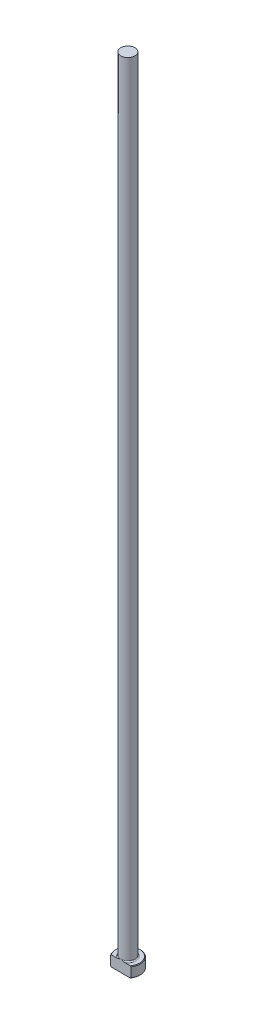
ISO-10303-21;
HEADER;
FILE_DESCRIPTION(('STEP AP214'),'2;1');
FILE_NAME('part.step','',(''),(''),'','','');
FILE_SCHEMA(('AUTOMOTIVE_DESIGN { 1 0 10303 214 1 1 1 1 }'));
ENDSEC;
DATA;
#1=APPLICATION_CONTEXT('core data for automotive mechanical design processes');
#2=APPLICATION_PROTOCOL_DEFINITION('international standard','automotive_design',2000,#1);
#3=PRODUCT_CONTEXT('',#1,'mechanical');
#4=PRODUCT('Part','Part','',(#3));
#5=PRODUCT_RELATED_PRODUCT_CATEGORY('part','',(#4));
#6=PRODUCT_DEFINITION_FORMATION('','',#4);
#7=PRODUCT_DEFINITION_CONTEXT('part definition',#1,'design');
#8=PRODUCT_DEFINITION('design','',#6,#7);
#9=PRODUCT_DEFINITION_SHAPE('','',#8);
#10=(LENGTH_UNIT() NAMED_UNIT(*) SI_UNIT(.MILLI.,.METRE.));
#11=(NAMED_UNIT(*) PLANE_ANGLE_UNIT() SI_UNIT($,.RADIAN.));
#12=(NAMED_UNIT(*) SI_UNIT($,.STERADIAN.) SOLID_ANGLE_UNIT());
#13=UNCERTAINTY_MEASURE_WITH_UNIT(LENGTH_MEASURE(1.E-05),#10,'distance_accuracy_value','');
#14=(GEOMETRIC_REPRESENTATION_CONTEXT(3) GLOBAL_UNCERTAINTY_ASSIGNED_CONTEXT((#13)) GLOBAL_UNIT_ASSIGNED_CONTEXT((#10,
#11,#12)) REPRESENTATION_CONTEXT('',''));
#15=CARTESIAN_POINT('',(0.,0.,0.));
#16=DIRECTION('',(0.,0.,1.));
#17=DIRECTION('',(1.,0.,0.));
#18=AXIS2_PLACEMENT_3D('',#15,#16,#17);
#19=CARTESIAN_POINT('',(0.,0.,0.));
#20=DIRECTION('',(0.,-1.,0.));
#21=DIRECTION('',(0.,0.,-1.));
#22=AXIS2_PLACEMENT_3D('',#19,#20,#21);
#23=PLANE('',#22);
#24=DIRECTION('',(1.,0.,0.));
#25=VECTOR('',#24,1.);
#26=CARTESIAN_POINT('',(-4.55200670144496,0.,3.17499999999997));
#27=LINE('',#26,#25);
#28=CARTESIAN_POINT('',(-4.23862381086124,0.,3.17499999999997));
#29=VERTEX_POINT('',#28);
#30=CARTESIAN_POINT('',(4.23862381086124,0.,3.17499999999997));
#31=VERTEX_POINT('',#30);
#32=EDGE_CURVE('E92',#29,#31,#27,.T.);
#33=ORIENTED_EDGE('',*,*,#32,.F.);
#34=CARTESIAN_POINT('',(0.,0.,0.));
#35=DIRECTION('',(0.,-1.,0.));
#36=DIRECTION('',(0.,0.,-1.));
#37=AXIS2_PLACEMENT_3D('',#34,#35,#36);
#38=CIRCLE('',#37,5.29589999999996);
#39=EDGE_CURVE('E105',#29,#31,#38,.T.);
#40=ORIENTED_EDGE('',*,*,#39,.T.);
#41=EDGE_LOOP('',(#33,#40));
#42=FACE_BOUND('',#41,.T.);
#43=ADVANCED_FACE('F37',(#42),#23,.T.);
#44=CARTESIAN_POINT('',(0.,259.958771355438,0.));
#45=DIRECTION('',(0.,1.,0.));
#46=DIRECTION('',(0.,0.,1.));
#47=AXIS2_PLACEMENT_3D('',#44,#45,#46);
#48=CYLINDRICAL_SURFACE('',#47,5.54989999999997);
#49=DIRECTION('',(0.,-1.,0.));
#50=VECTOR('',#49,1.);
#51=CARTESIAN_POINT('',(-4.55200670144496,355.6,3.17499999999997));
#52=LINE('',#51,#50);
#53=CARTESIAN_POINT('',(-4.55200670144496,4.49579999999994,3.17499999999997));
#54=VERTEX_POINT('',#53);
#55=CARTESIAN_POINT('',(-4.55200670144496,0.254000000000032,3.17499999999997));
#56=VERTEX_POINT('',#55);
#57=EDGE_CURVE('E95',#54,#56,#52,.T.);
#58=ORIENTED_EDGE('',*,*,#57,.F.);
#59=CARTESIAN_POINT('',(0.,4.49579999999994,0.));
#60=DIRECTION('',(0.,1.,0.));
#61=DIRECTION('',(0.,0.,1.));
#62=AXIS2_PLACEMENT_3D('',#59,#60,#61);
#63=CIRCLE('',#62,5.54989999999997);
#64=CARTESIAN_POINT('',(4.55200670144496,4.49579999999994,3.17499999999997));
#65=VERTEX_POINT('',#64);
#66=EDGE_CURVE('E109',#54,#65,#63,.F.);
#67=ORIENTED_EDGE('',*,*,#66,.T.);
#68=DIRECTION('',(0.,-1.,0.));
#69=VECTOR('',#68,1.);
#70=CARTESIAN_POINT('',(4.55200670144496,355.6,3.17499999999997));
#71=LINE('',#70,#69);
#72=CARTESIAN_POINT('',(4.55200670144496,0.254000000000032,3.17499999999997));
#73=VERTEX_POINT('',#72);
#74=EDGE_CURVE('E187',#65,#73,#71,.T.);
#75=ORIENTED_EDGE('',*,*,#74,.T.);
#76=CARTESIAN_POINT('',(0.,0.254000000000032,0.));
#77=DIRECTION('',(0.,-1.,0.));
#78=DIRECTION('',(0.,0.,-1.));
#79=AXIS2_PLACEMENT_3D('',#76,#77,#78);
#80=CIRCLE('',#79,5.54989999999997);
#81=EDGE_CURVE('E115',#73,#56,#80,.F.);
#82=ORIENTED_EDGE('',*,*,#81,.T.);
#83=EDGE_LOOP('',(#58,#67,#75,#82));
#84=FACE_BOUND('',#83,.T.);
#85=ADVANCED_FACE('F160',(#84),#48,.T.);
#86=CARTESIAN_POINT('',(-5.54989999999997,4.7498,0.));
#87=DIRECTION('',(0.,1.,0.));
#88=DIRECTION('',(0.,0.,1.));
#89=AXIS2_PLACEMENT_3D('',#86,#87,#88);
#90=PLANE('',#89);
#91=DIRECTION('',(-1.,0.,0.));
#92=VECTOR('',#91,1.);
#93=CARTESIAN_POINT('',(-5.54989999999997,4.7498,3.17499999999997));
#94=LINE('',#93,#92);
#95=CARTESIAN_POINT('',(4.2386238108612,4.7498,3.17499999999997));
#96=VERTEX_POINT('',#95);
#97=CARTESIAN_POINT('',(1.86651118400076,4.7498,3.17499999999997));
#98=VERTEX_POINT('',#97);
#99=EDGE_CURVE('E58',#96,#98,#94,.T.);
#100=ORIENTED_EDGE('',*,*,#99,.F.);
#101=CARTESIAN_POINT('',(0.,4.7498,0.));
#102=DIRECTION('',(0.,1.,0.));
#103=DIRECTION('',(0.,0.,1.));
#104=AXIS2_PLACEMENT_3D('',#101,#102,#103);
#105=CIRCLE('',#104,5.29589999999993);
#106=CARTESIAN_POINT('',(-4.2386238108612,4.7498,3.17499999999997));
#107=VERTEX_POINT('',#106);
#108=EDGE_CURVE('E182',#96,#107,#105,.T.);
#109=ORIENTED_EDGE('',*,*,#108,.T.);
#110=CARTESIAN_POINT('',(-1.86651118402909,4.74979999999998,3.17499999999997));
#111=VERTEX_POINT('',#110);
#112=EDGE_CURVE('E140',#111,#107,#94,.T.);
#113=ORIENTED_EDGE('',*,*,#112,.F.);
#114=CARTESIAN_POINT('',(0.,4.7498,0.));
#115=DIRECTION('',(0.,1.,0.));
#116=DIRECTION('',(0.,0.,1.));
#117=AXIS2_PLACEMENT_3D('',#114,#115,#116);
#118=CIRCLE('',#117,3.68299999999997);
#119=EDGE_CURVE('E112',#111,#98,#118,.F.);
#120=ORIENTED_EDGE('',*,*,#119,.T.);
#121=EDGE_LOOP('',(#100,#109,#113,#120));
#122=FACE_BOUND('',#121,.T.);
#123=ADVANCED_FACE('F164',(#122),#90,.T.);
#124=CARTESIAN_POINT('',(0.,259.958771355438,0.));
#125=DIRECTION('',(0.,1.,0.));
#126=DIRECTION('',(0.,0.,1.));
#127=AXIS2_PLACEMENT_3D('',#124,#125,#126);
#128=CYLINDRICAL_SURFACE('',#127,3.17499999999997);
#129=CARTESIAN_POINT('',(0.,5.25779999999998,0.));
#130=DIRECTION('',(0.,1.,0.));
#131=DIRECTION('',(0.,0.,1.));
#132=AXIS2_PLACEMENT_3D('',#129,#130,#131);
#133=CIRCLE('',#132,3.17499999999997);
#134=CARTESIAN_POINT('',(0.,5.25779999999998,3.17499999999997));
#135=VERTEX_POINT('',#134);
#136=EDGE_CURVE('E108',#135,#135,#133,.T.);
#137=ORIENTED_EDGE('',*,*,#136,.T.);
#138=EDGE_LOOP('',(#137));
#139=FACE_BOUND('',#138,.T.);
#140=CARTESIAN_POINT('',(0.,355.6,0.));
#141=DIRECTION('',(0.,1.,0.));
#142=DIRECTION('',(0.,0.,1.));
#143=AXIS2_PLACEMENT_3D('',#140,#141,#142);
#144=CIRCLE('',#143,3.17499999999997);
#145=CARTESIAN_POINT('',(0.,355.6,3.17499999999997));
#146=VERTEX_POINT('',#145);
#147=EDGE_CURVE('E100',#146,#146,#144,.T.);
#148=ORIENTED_EDGE('',*,*,#147,.F.);
#149=EDGE_LOOP('',(#148));
#150=FACE_BOUND('',#149,.T.);
#151=ADVANCED_FACE('F169',(#139,#150),#128,.T.);
#152=CARTESIAN_POINT('',(-3.17499999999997,355.6,0.));
#153=DIRECTION('',(0.,1.,0.));
#154=DIRECTION('',(0.,0.,1.));
#155=AXIS2_PLACEMENT_3D('',#152,#153,#154);
#156=PLANE('',#155);
#157=ORIENTED_EDGE('',*,*,#147,.T.);
#158=EDGE_LOOP('',(#157));
#159=FACE_BOUND('',#158,.T.);
#160=ADVANCED_FACE('F127',(#159),#156,.T.);
#161=CARTESIAN_POINT('',(0.,4.74980000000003,0.));
#162=DIRECTION('',(0.,-1.,0.));
#163=DIRECTION('',(0.,0.,-1.));
#164=AXIS2_PLACEMENT_3D('',#161,#162,#163);
#165=CONICAL_SURFACE('',#164,5.29589999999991,0.785398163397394);
#166=CARTESIAN_POINT('',(4.55270670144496,4.49522584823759,3.17499999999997));
#167=CARTESIAN_POINT('',(4.46867102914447,4.56415111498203,3.17499999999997));
#168=CARTESIAN_POINT('',(4.38433366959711,4.6327080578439,3.17499999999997));
#169=CARTESIAN_POINT('',(4.2149585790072,4.76896195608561,3.17499999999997));
#170=CARTESIAN_POINT('',(4.12992080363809,4.83665885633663,3.17499999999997));
#171=CARTESIAN_POINT('',(3.87336504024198,5.03846775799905,3.17499999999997));
#172=CARTESIAN_POINT('',(3.70066220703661,5.17108543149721,3.17499999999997));
#173=CARTESIAN_POINT('',(3.34705509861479,5.43386049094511,3.17499999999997));
#174=CARTESIAN_POINT('',(3.16605347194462,5.56388747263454,3.17499999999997));
#175=CARTESIAN_POINT('',(2.79841706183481,5.81560063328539,3.17499999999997));
#176=CARTESIAN_POINT('',(2.61178598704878,5.93729213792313,3.17499999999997));
#177=CARTESIAN_POINT('',(2.30973308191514,6.12043895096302,3.17499999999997));
#178=CARTESIAN_POINT('',(2.19679966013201,6.18598374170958,3.17499999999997));
#179=CARTESIAN_POINT('',(1.96784721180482,6.31155139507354,3.17499999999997));
#180=CARTESIAN_POINT('',(1.85182762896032,6.3715732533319,3.17499999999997));
#181=CARTESIAN_POINT('',(1.61688838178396,6.48418645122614,3.17499999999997));
#182=CARTESIAN_POINT('',(1.49798536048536,6.53681215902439,3.17499999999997));
#183=CARTESIAN_POINT('',(1.25651684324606,6.63289856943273,3.17499999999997));
#184=CARTESIAN_POINT('',(1.13395292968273,6.67636316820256,3.17499999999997));
#185=CARTESIAN_POINT('',(0.91783963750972,6.74185258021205,3.17499999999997));
#186=CARTESIAN_POINT('',(0.825091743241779,6.76651140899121,3.17499999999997));
#187=CARTESIAN_POINT('',(0.637965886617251,6.80852168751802,3.17499999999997));
#188=CARTESIAN_POINT('',(0.543588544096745,6.82587585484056,3.17499999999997));
#189=CARTESIAN_POINT('',(0.353913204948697,6.85241185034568,3.17499999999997));
#190=CARTESIAN_POINT('',(0.258618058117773,6.86161375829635,3.17499999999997));
#191=CARTESIAN_POINT('',(0.0675813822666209,6.87141333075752,3.17499999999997));
#192=CARTESIAN_POINT('',(-0.0281601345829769,6.87201122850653,3.17499999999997));
#193=CARTESIAN_POINT('',(-0.219319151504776,6.86456808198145,3.17499999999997));
#194=CARTESIAN_POINT('',(-0.314736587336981,6.85652541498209,3.17499999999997));
#195=CARTESIAN_POINT('',(-0.50451468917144,6.83224444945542,3.17499999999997));
#196=CARTESIAN_POINT('',(-0.598875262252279,6.8160054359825,3.17499999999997));
#197=CARTESIAN_POINT('',(-0.786308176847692,6.77606898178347,3.17499999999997));
#198=CARTESIAN_POINT('',(-0.879375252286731,6.75234715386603,3.17499999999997));
#199=CARTESIAN_POINT('',(-1.06359579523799,6.69844771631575,3.17499999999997));
#200=CARTESIAN_POINT('',(-1.15474927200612,6.66827013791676,3.17499999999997));
#201=CARTESIAN_POINT('',(-1.35443704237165,6.59537857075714,3.17499999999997));
#202=CARTESIAN_POINT('',(-1.46249374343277,6.5513642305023,3.17499999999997));
#203=CARTESIAN_POINT('',(-1.67575460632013,6.45687950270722,3.17499999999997));
#204=CARTESIAN_POINT('',(-1.78095773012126,6.40640680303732,3.17499999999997));
#205=CARTESIAN_POINT('',(-1.98893047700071,6.30024153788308,3.17499999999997));
#206=CARTESIAN_POINT('',(-2.09169504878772,6.24453915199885,3.17499999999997));
#207=CARTESIAN_POINT('',(-2.29487199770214,6.12905867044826,3.17499999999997));
#208=CARTESIAN_POINT('',(-2.39528472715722,6.06928119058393,3.17499999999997));
#209=CARTESIAN_POINT('',(-2.59468704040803,5.94608525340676,3.17499999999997));
#210=CARTESIAN_POINT('',(-2.69366424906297,5.88264685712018,3.17499999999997));
#211=CARTESIAN_POINT('',(-2.88985302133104,5.75309438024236,3.17499999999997));
#212=CARTESIAN_POINT('',(-2.9870644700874,5.6869801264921,3.17499999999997));
#213=CARTESIAN_POINT('',(-3.27623595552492,5.48553168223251,3.17499999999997));
#214=CARTESIAN_POINT('',(-3.46594038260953,5.34696081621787,3.17499999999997));
#215=CARTESIAN_POINT('',(-3.80657840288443,5.08982954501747,3.17499999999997));
#216=CARTESIAN_POINT('',(-3.95825741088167,4.97224445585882,3.17499999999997));
#217=CARTESIAN_POINT('',(-4.1832860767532,4.79418265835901,3.17499999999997));
#218=CARTESIAN_POINT('',(-4.25753159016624,4.73483567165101,3.17499999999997));
#219=CARTESIAN_POINT('',(-4.40549753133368,4.61549484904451,3.17499999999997));
#220=CARTESIAN_POINT('',(-4.47921797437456,4.5555010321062,3.17499999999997));
#221=CARTESIAN_POINT('',(-4.55270670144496,4.49522584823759,3.17499999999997));
#222=B_SPLINE_CURVE_WITH_KNOTS('',3,(#166,#167,#168,#169,#170,#171,#172,#173,#174,#175,#176,
#177,#178,#179,#180,#181,#182,#183,#184,#185,#186,#187,#188,#189,#190,#191,#192,#193,#194,#195,
#196,#197,#198,#199,#200,#201,#202,#203,#204,#205,#206,#207,#208,#209,#210,#211,#212,#213,#214,
#215,#216,#217,#218,#219,#220,#221),.UNSPECIFIED.,.F.,.F.,(4,2,2,2,2,2,2,2,2,2,2,2,2,2,2,2,2,2,
2,2,2,2,2,2,2,2,2,4),(0.,0.326056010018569,0.652132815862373,1.30528807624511,1.97374354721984,
2.64176786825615,3.03338079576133,3.42506479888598,3.81486388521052,4.20449685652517,
4.49215659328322,4.77970921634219,5.06655158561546,5.35338617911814,5.64027465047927,
5.92718815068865,6.2150465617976,6.50290358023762,6.85266171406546,7.20254541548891,
7.5530998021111,7.90360133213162,8.25623530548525,8.60889213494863,9.31347102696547,
9.88918933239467,10.174335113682,10.459472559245),.UNSPECIFIED.);
#223=EDGE_CURVE('E63',#65,#96,#222,.T.);
#224=ORIENTED_EDGE('',*,*,#223,.F.);
#225=ORIENTED_EDGE('',*,*,#66,.F.);
#226=EDGE_CURVE('E133',#107,#54,#222,.T.);
#227=ORIENTED_EDGE('',*,*,#226,.F.);
#228=ORIENTED_EDGE('',*,*,#108,.F.);
#229=EDGE_LOOP('',(#224,#225,#227,#228));
#230=FACE_BOUND('',#229,.T.);
#231=ADVANCED_FACE('F147',(#230),#165,.T.);
#232=CARTESIAN_POINT('',(0.,0.254000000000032,0.));
#233=DIRECTION('',(0.,1.,0.));
#234=DIRECTION('',(0.,0.,1.));
#235=AXIS2_PLACEMENT_3D('',#232,#233,#234);
#236=CONICAL_SURFACE('',#235,5.54989999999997,0.785398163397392);
#237=CARTESIAN_POINT('',(-4.55270670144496,0.254574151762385,3.17499999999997));
#238=CARTESIAN_POINT('',(-4.46867102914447,0.185648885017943,3.17499999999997));
#239=CARTESIAN_POINT('',(-4.38433366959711,0.117091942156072,3.17499999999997));
#240=CARTESIAN_POINT('',(-4.2149585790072,-0.019161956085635,3.17499999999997));
#241=CARTESIAN_POINT('',(-4.12992080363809,-0.0868588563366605,3.17499999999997));
#242=CARTESIAN_POINT('',(-3.87336504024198,-0.288667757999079,3.17499999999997));
#243=CARTESIAN_POINT('',(-3.70066220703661,-0.421285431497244,3.17499999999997));
#244=CARTESIAN_POINT('',(-3.3470550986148,-0.684060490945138,3.17499999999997));
#245=CARTESIAN_POINT('',(-3.16605347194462,-0.814087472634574,3.17499999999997));
#246=CARTESIAN_POINT('',(-2.79841706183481,-1.06580063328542,3.17499999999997));
#247=CARTESIAN_POINT('',(-2.61178598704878,-1.18749213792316,3.17499999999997));
#248=CARTESIAN_POINT('',(-2.30973308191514,-1.37063895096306,3.17499999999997));
#249=CARTESIAN_POINT('',(-2.19679966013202,-1.43618374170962,3.17499999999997));
#250=CARTESIAN_POINT('',(-1.96784721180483,-1.56175139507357,3.17499999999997));
#251=CARTESIAN_POINT('',(-1.85182762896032,-1.62177325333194,3.17499999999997));
#252=CARTESIAN_POINT('',(-1.61688838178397,-1.73438645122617,3.17499999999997));
#253=CARTESIAN_POINT('',(-1.49798536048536,-1.78701215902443,3.17499999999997));
#254=CARTESIAN_POINT('',(-1.25651684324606,-1.88309856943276,3.17499999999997));
#255=CARTESIAN_POINT('',(-1.13395292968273,-1.92656316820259,3.17499999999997));
#256=CARTESIAN_POINT('',(-0.917839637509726,-1.99205258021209,3.17499999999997));
#257=CARTESIAN_POINT('',(-0.825091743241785,-2.01671140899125,3.17499999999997));
#258=CARTESIAN_POINT('',(-0.637965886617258,-2.05872168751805,3.17499999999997));
#259=CARTESIAN_POINT('',(-0.543588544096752,-2.07607585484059,3.17499999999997));
#260=CARTESIAN_POINT('',(-0.353913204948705,-2.10261185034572,3.17499999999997));
#261=CARTESIAN_POINT('',(-0.258618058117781,-2.11181375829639,3.17499999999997));
#262=CARTESIAN_POINT('',(-0.0675813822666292,-2.12161333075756,3.17499999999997));
#263=CARTESIAN_POINT('',(0.0281601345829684,-2.12221122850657,3.17499999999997));
#264=CARTESIAN_POINT('',(0.219319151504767,-2.11476808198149,3.17499999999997));
#265=CARTESIAN_POINT('',(0.314736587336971,-2.10672541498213,3.17499999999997));
#266=CARTESIAN_POINT('',(0.50451468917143,-2.08244444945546,3.17499999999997));
#267=CARTESIAN_POINT('',(0.598875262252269,-2.06620543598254,3.17499999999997));
#268=CARTESIAN_POINT('',(0.786308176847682,-2.02626898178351,3.17499999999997));
#269=CARTESIAN_POINT('',(0.879375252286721,-2.00254715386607,3.17499999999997));
#270=CARTESIAN_POINT('',(1.06359579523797,-1.94864771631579,3.17499999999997));
#271=CARTESIAN_POINT('',(1.15474927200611,-1.91847013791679,3.17499999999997));
#272=CARTESIAN_POINT('',(1.35443704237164,-1.84557857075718,3.17499999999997));
#273=CARTESIAN_POINT('',(1.46249374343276,-1.80156423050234,3.17499999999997));
#274=CARTESIAN_POINT('',(1.67575460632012,-1.70707950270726,3.17499999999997));
#275=CARTESIAN_POINT('',(1.78095773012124,-1.65660680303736,3.17499999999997));
#276=CARTESIAN_POINT('',(1.98893047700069,-1.55044153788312,3.17499999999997));
#277=CARTESIAN_POINT('',(2.0916950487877,-1.49473915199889,3.17499999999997));
#278=CARTESIAN_POINT('',(2.29487199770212,-1.37925867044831,3.17499999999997));
#279=CARTESIAN_POINT('',(2.39528472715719,-1.31948119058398,3.17499999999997));
#280=CARTESIAN_POINT('',(2.59468704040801,-1.19628525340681,3.17499999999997));
#281=CARTESIAN_POINT('',(2.69366424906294,-1.13284685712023,3.17499999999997));
#282=CARTESIAN_POINT('',(2.88985302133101,-1.00329438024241,3.17499999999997));
#283=CARTESIAN_POINT('',(2.98706447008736,-0.937180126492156,3.17499999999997));
#284=CARTESIAN_POINT('',(3.27623595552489,-0.735731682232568,3.17499999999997));
#285=CARTESIAN_POINT('',(3.46594038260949,-0.597160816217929,3.17499999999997));
#286=CARTESIAN_POINT('',(3.8065784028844,-0.340029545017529,3.17499999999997));
#287=CARTESIAN_POINT('',(3.95825741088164,-0.222444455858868,3.17499999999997));
#288=CARTESIAN_POINT('',(4.18328607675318,-0.0443826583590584,3.17499999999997));
#289=CARTESIAN_POINT('',(4.25753159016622,0.0149643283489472,3.17499999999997));
#290=CARTESIAN_POINT('',(4.40549753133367,0.134305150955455,3.17499999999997));
#291=CARTESIAN_POINT('',(4.47921797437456,0.194298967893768,3.17499999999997));
#292=CARTESIAN_POINT('',(4.55270670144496,0.254574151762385,3.17499999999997));
#293=B_SPLINE_CURVE_WITH_KNOTS('',3,(#237,#238,#239,#240,#241,#242,#243,#244,#245,#246,#247,
#248,#249,#250,#251,#252,#253,#254,#255,#256,#257,#258,#259,#260,#261,#262,#263,#264,#265,#266,
#267,#268,#269,#270,#271,#272,#273,#274,#275,#276,#277,#278,#279,#280,#281,#282,#283,#284,#285,
#286,#287,#288,#289,#290,#291,#292),.UNSPECIFIED.,.F.,.F.,(4,2,2,2,2,2,2,2,2,2,2,2,2,2,2,2,2,2,
2,2,2,2,2,2,2,2,2,4),(0.,0.326056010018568,0.652132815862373,1.30528807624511,1.97374354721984,
2.64176786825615,3.03338079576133,3.42506479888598,3.81486388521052,4.20449685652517,
4.49215659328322,4.77970921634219,5.06655158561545,5.35338617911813,5.64027465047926,
5.92718815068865,6.21504656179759,6.50290358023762,6.85266171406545,7.20254541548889,
7.55309980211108,7.90360133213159,8.25623530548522,8.6088921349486,9.31347102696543,
9.88918933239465,10.174335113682,10.459472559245),.UNSPECIFIED.);
#294=EDGE_CURVE('E89',#56,#29,#293,.T.);
#295=ORIENTED_EDGE('',*,*,#294,.F.);
#296=ORIENTED_EDGE('',*,*,#81,.F.);
#297=EDGE_CURVE('E101',#31,#73,#293,.T.);
#298=ORIENTED_EDGE('',*,*,#297,.F.);
#299=ORIENTED_EDGE('',*,*,#39,.F.);
#300=EDGE_LOOP('',(#295,#296,#298,#299));
#301=FACE_BOUND('',#300,.T.);
#302=ADVANCED_FACE('F107',(#301),#236,.T.);
#303=CARTESIAN_POINT('',(0.,5.25779999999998,0.));
#304=DIRECTION('',(0.,1.,0.));
#305=DIRECTION('',(0.,0.,1.));
#306=AXIS2_PLACEMENT_3D('',#303,#304,#305);
#307=TOROIDAL_SURFACE('',#306,3.68299999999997,0.508);
#308=ORIENTED_EDGE('',*,*,#119,.F.);
#309=CARTESIAN_POINT('',(0.,5.25779999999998,3.17499999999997));
#310=CARTESIAN_POINT('',(-1.80769053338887E-10,5.25780081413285,3.17499999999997));
#311=CARTESIAN_POINT('',(-1.73023885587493E-07,5.25780162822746,3.17499999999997));
#312=CARTESIAN_POINT('',(-7.19628533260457E-07,5.25780319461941,3.17499999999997));
#313=CARTESIAN_POINT('',(-1.09883574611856E-06,5.25780394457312,3.17499999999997));
#314=CARTESIAN_POINT('',(-2.00966877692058E-06,5.25780544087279,3.17499999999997));
#315=CARTESIAN_POINT('',(-2.55212990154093E-06,5.25780618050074,3.17499999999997));
#316=CARTESIAN_POINT('',(-3.72136332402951E-06,5.25780757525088,3.17499999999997));
#317=CARTESIAN_POINT('',(-4.34736599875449E-06,5.25780823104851,3.17499999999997));
#318=CARTESIAN_POINT('',(-6.59438229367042E-06,5.25781043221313,3.17499999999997));
#319=CARTESIAN_POINT('',(-8.32481538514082E-06,5.25781186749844,3.17499999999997));
#320=CARTESIAN_POINT('',(-1.18988287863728E-05,5.25781442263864,3.17499999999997));
#321=CARTESIAN_POINT('',(-1.37358815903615E-05,5.25781555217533,3.17499999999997));
#322=CARTESIAN_POINT('',(-2.09135300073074E-05,5.25781980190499,3.17499999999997));
#323=CARTESIAN_POINT('',(-2.63912469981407E-05,5.25782270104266,3.17499999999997));
#324=CARTESIAN_POINT('',(-3.71867761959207E-05,5.25782743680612,3.17499999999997));
#325=CARTESIAN_POINT('',(-4.24736618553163E-05,5.25782934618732,3.17499999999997));
#326=CARTESIAN_POINT('',(-6.50188365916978E-05,5.25783746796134,3.17499999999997));
#327=CARTESIAN_POINT('',(-8.22815781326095E-05,5.25784363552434,3.17499999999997));
#328=CARTESIAN_POINT('',(-0.000114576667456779,5.25785352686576,3.17499999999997));
#329=CARTESIAN_POINT('',(-0.000129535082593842,5.25785748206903,3.17499999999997));
#330=CARTESIAN_POINT('',(-0.000238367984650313,5.25788883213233,3.17499999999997));
#331=CARTESIAN_POINT('',(-0.000328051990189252,5.25792882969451,3.17499999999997));
#332=CARTESIAN_POINT('',(-0.000676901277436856,5.25807871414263,3.17499999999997));
#333=CARTESIAN_POINT('',(-0.000938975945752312,5.25817923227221,3.17499999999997));
#334=CARTESIAN_POINT('',(-0.001957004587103,5.25857549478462,3.17499999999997));
#335=CARTESIAN_POINT('',(-0.00270997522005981,5.25888105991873,3.17499999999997));
#336=CARTESIAN_POINT('',(-0.00579427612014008,5.26012678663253,3.17499999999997));
#337=CARTESIAN_POINT('',(-0.00812889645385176,5.26105588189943,3.17499999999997));
#338=CARTESIAN_POINT('',(-0.0536737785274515,5.27918868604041,3.17499999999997));
#339=CARTESIAN_POINT('',(-0.0968493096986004,5.29651116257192,3.17499999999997));
#340=CARTESIAN_POINT('',(-0.181675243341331,5.33030366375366,3.17499999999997));
#341=CARTESIAN_POINT('',(-0.22332279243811,5.34678146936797,3.17499999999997));
#342=CARTESIAN_POINT('',(-0.311600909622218,5.38141206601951,3.17499999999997));
#343=CARTESIAN_POINT('',(-0.358243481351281,5.39953485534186,3.17499999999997));
#344=CARTESIAN_POINT('',(-0.452199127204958,5.43546002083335,3.17499999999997));
#345=CARTESIAN_POINT('',(-0.499514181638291,5.4532572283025,3.17499999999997));
#346=CARTESIAN_POINT('',(-0.581915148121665,5.48356219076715,3.17499999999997));
#347=CARTESIAN_POINT('',(-0.616942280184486,5.49622931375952,3.17499999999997));
#348=CARTESIAN_POINT('',(-0.687074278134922,5.52107238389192,3.17499999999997));
#349=CARTESIAN_POINT('',(-0.722178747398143,5.53324945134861,3.17499999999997));
#350=CARTESIAN_POINT('',(-0.82617821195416,5.56842938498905,3.17499999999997));
#351=CARTESIAN_POINT('',(-0.895335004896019,5.59066808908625,3.17499999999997));
#352=CARTESIAN_POINT('',(-1.04440355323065,5.63534989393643,3.17499999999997));
#353=CARTESIAN_POINT('',(-1.12444395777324,5.65737079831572,3.17499999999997));
#354=CARTESIAN_POINT('',(-1.28636529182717,5.69671209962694,3.17499999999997));
#355=CARTESIAN_POINT('',(-1.36825573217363,5.71399428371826,3.17499999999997));
#356=CARTESIAN_POINT('',(-1.53827501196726,5.74289044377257,3.17499999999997));
#357=CARTESIAN_POINT('',(-1.6264772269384,5.754089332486,3.17499999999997));
#358=CARTESIAN_POINT('',(-1.80336979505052,5.766538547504,3.17499999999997));
#359=CARTESIAN_POINT('',(-1.89205668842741,5.76782927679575,3.17499999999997));
#360=CARTESIAN_POINT('',(-2.04614946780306,5.75829207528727,3.17499999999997));
#361=CARTESIAN_POINT('',(-2.1117267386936,5.7504696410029,3.17499999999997));
#362=CARTESIAN_POINT('',(-2.24032569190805,5.72527330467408,3.17499999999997));
#363=CARTESIAN_POINT('',(-2.30336992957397,5.70802985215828,3.17499999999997));
#364=CARTESIAN_POINT('',(-2.3964725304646,5.67213651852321,3.17499999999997));
#365=CARTESIAN_POINT('',(-2.42822079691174,5.65788049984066,3.17499999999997));
#366=CARTESIAN_POINT('',(-2.48965433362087,5.62525897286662,3.17499999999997));
#367=CARTESIAN_POINT('',(-2.51933677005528,5.60688795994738,3.17499999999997));
#368=CARTESIAN_POINT('',(-2.56994777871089,5.56951032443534,3.17499999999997));
#369=CARTESIAN_POINT('',(-2.59146237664,5.55130442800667,3.17499999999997));
#370=CARTESIAN_POINT('',(-2.63132394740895,5.5117021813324,3.17499999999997));
#371=CARTESIAN_POINT('',(-2.64967743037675,5.49031256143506,3.17499999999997));
#372=CARTESIAN_POINT('',(-2.67804602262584,5.4500327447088,3.17499999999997));
#373=CARTESIAN_POINT('',(-2.6890027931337,5.43180880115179,3.17499999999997));
#374=CARTESIAN_POINT('',(-2.7078017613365,5.3938065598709,3.17499999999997));
#375=CARTESIAN_POINT('',(-2.71564587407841,5.37402922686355,3.17499999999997));
#376=CARTESIAN_POINT('',(-2.72769754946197,5.33322214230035,3.17499999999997));
#377=CARTESIAN_POINT('',(-2.73187843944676,5.31218437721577,3.17499999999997));
#378=CARTESIAN_POINT('',(-2.73613267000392,5.26969745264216,3.17499999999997));
#379=CARTESIAN_POINT('',(-2.73620805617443,5.24824850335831,3.17499999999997));
#380=CARTESIAN_POINT('',(-2.73247730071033,5.20813635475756,3.17499999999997));
#381=CARTESIAN_POINT('',(-2.72910595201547,5.18943073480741,3.17499999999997));
#382=CARTESIAN_POINT('',(-2.71937153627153,5.15282145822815,3.17499999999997));
#383=CARTESIAN_POINT('',(-2.71300800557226,5.13491792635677,3.17499999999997));
#384=CARTESIAN_POINT('',(-2.69740230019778,5.0996670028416,3.17499999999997));
#385=CARTESIAN_POINT('',(-2.68806645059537,5.08236154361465,3.17499999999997));
#386=CARTESIAN_POINT('',(-2.66708571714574,5.04922644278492,3.17499999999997));
#387=CARTESIAN_POINT('',(-2.65543987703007,5.03339741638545,3.17499999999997));
#388=CARTESIAN_POINT('',(-2.62294588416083,4.99450310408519,3.17499999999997));
#389=CARTESIAN_POINT('',(-2.60069446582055,4.9726078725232,3.17499999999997));
#390=CARTESIAN_POINT('',(-2.55299669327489,4.93259922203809,3.17499999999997));
#391=CARTESIAN_POINT('',(-2.52754047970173,4.91449795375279,3.17499999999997));
#392=CARTESIAN_POINT('',(-2.46015073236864,4.87290115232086,3.17499999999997));
#393=CARTESIAN_POINT('',(-2.41675555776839,4.85178783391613,3.17499999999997));
#394=CARTESIAN_POINT('',(-2.32743780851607,4.81642640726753,3.17499999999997));
#395=CARTESIAN_POINT('',(-2.28151740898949,4.80217249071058,3.17499999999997));
#396=CARTESIAN_POINT('',(-2.19492730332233,4.78086425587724,3.17499999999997));
#397=CARTESIAN_POINT('',(-2.15443153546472,4.77307762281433,3.17499999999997));
#398=CARTESIAN_POINT('',(-2.07290577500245,4.7609987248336,3.17499999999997));
#399=CARTESIAN_POINT('',(-2.03187536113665,4.75670940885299,3.17499999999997));
#400=CARTESIAN_POINT('',(-1.90717655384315,4.74822293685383,3.17499999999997));
#401=CARTESIAN_POINT('',(-1.82319261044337,4.74868666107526,3.17499999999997));
#402=CARTESIAN_POINT('',(-1.62833175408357,4.76032593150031,3.17499999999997));
#403=CARTESIAN_POINT('',(-1.51770881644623,4.77497959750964,3.17499999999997));
#404=CARTESIAN_POINT('',(-1.29813873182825,4.81534590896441,3.17499999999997));
#405=CARTESIAN_POINT('',(-1.18920134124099,4.84110792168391,3.17499999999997));
#406=CARTESIAN_POINT('',(-0.982215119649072,4.89780610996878,3.17499999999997));
#407=CARTESIAN_POINT('',(-0.883999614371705,4.92815337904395,3.17499999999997));
#408=CARTESIAN_POINT('',(-0.689996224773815,4.99284004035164,3.17499999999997));
#409=CARTESIAN_POINT('',(-0.594193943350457,5.02713703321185,3.17499999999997));
#410=CARTESIAN_POINT('',(-0.464142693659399,5.07567249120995,3.17499999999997));
#411=CARTESIAN_POINT('',(-0.429471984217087,5.08880513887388,3.17499999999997));
#412=CARTESIAN_POINT('',(-0.359331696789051,5.11568278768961,3.17499999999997));
#413=CARTESIAN_POINT('',(-0.323864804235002,5.12943483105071,3.17499999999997));
#414=CARTESIAN_POINT('',(-0.263992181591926,5.15284621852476,3.17499999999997));
#415=CARTESIAN_POINT('',(-0.239565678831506,5.16245280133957,3.17499999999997));
#416=CARTESIAN_POINT('',(-0.190982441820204,5.18164529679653,3.17499999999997));
#417=CARTESIAN_POINT('',(-0.166825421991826,5.19123047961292,3.17499999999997));
#418=CARTESIAN_POINT('',(-0.121037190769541,5.20943918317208,3.17499999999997));
#419=CARTESIAN_POINT('',(-0.0994044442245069,5.21805909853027,3.17499999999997));
#420=CARTESIAN_POINT('',(-0.0553410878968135,5.2356763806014,3.17499999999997));
#421=CARTESIAN_POINT('',(-0.0329111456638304,5.24467572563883,3.17499999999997));
#422=CARTESIAN_POINT('',(-0.00813211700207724,5.25454302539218,3.17499999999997));
#423=CARTESIAN_POINT('',(-0.00580062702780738,5.25547072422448,3.17499999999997));
#424=CARTESIAN_POINT('',(-0.00271708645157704,5.25671609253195,3.17499999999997));
#425=CARTESIAN_POINT('',(-0.00196172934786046,5.25702263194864,3.17499999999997));
#426=CARTESIAN_POINT('',(-0.000940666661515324,5.25742007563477,3.17499999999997));
#427=CARTESIAN_POINT('',(-0.000677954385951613,5.25752083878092,3.17499999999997));
#428=CARTESIAN_POINT('',(-0.000328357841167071,5.25767104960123,3.17499999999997));
#429=CARTESIAN_POINT('',(-0.000238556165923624,5.25771109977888,3.17499999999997));
#430=CARTESIAN_POINT('',(-0.000129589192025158,5.25774247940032,3.17499999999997));
#431=CARTESIAN_POINT('',(-0.000114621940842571,5.25774643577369,3.17499999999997));
#432=CARTESIAN_POINT('',(-8.23074123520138E-05,5.25775633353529,3.17499999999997));
#433=CARTESIAN_POINT('',(-6.50343069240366E-05,5.25776250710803,3.17499999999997));
#434=CARTESIAN_POINT('',(-4.24775013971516E-05,5.25777063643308,3.17499999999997));
#435=CARTESIAN_POINT('',(-3.71892385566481E-05,5.25777254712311,3.17499999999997));
#436=CARTESIAN_POINT('',(-2.63911145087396E-05,5.25777728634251,3.17499999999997));
#437=CARTESIAN_POINT('',(-2.09122302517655E-05,5.25778018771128,3.17499999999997));
#438=CARTESIAN_POINT('',(-1.37334835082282E-05,5.25778444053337,3.17499999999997));
#439=CARTESIAN_POINT('',(-1.189632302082E-05,5.25778557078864,3.17499999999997));
#440=CARTESIAN_POINT('',(-8.32223670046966E-06,5.25778812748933,3.17499999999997));
#441=CARTESIAN_POINT('',(-6.59184566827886E-06,5.25778956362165,3.17499999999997));
#442=CARTESIAN_POINT('',(-4.34505756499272E-06,5.25779176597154,3.17499999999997));
#443=CARTESIAN_POINT('',(-3.71915459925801E-06,5.25779242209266,3.17499999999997));
#444=CARTESIAN_POINT('',(-2.55017854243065E-06,5.25779381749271,3.17499999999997));
#445=CARTESIAN_POINT('',(-2.00787573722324E-06,5.25779455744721,3.17499999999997));
#446=CARTESIAN_POINT('',(-1.09742559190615E-06,5.25779605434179,3.17499999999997));
#447=CARTESIAN_POINT('',(-7.18435041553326E-07,5.25779680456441,3.17499999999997));
#448=CARTESIAN_POINT('',(-1.72356606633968E-07,5.25779837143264,3.17499999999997));
#449=CARTESIAN_POINT('',(1.80798290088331E-10,5.25779918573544,3.17499999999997));
#450=CARTESIAN_POINT('',(0.,5.25779999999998,3.17499999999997));
#451=B_SPLINE_CURVE_WITH_KNOTS('',3,(#309,#310,#311,#312,#313,#314,#315,#316,#317,#318,#319,
#320,#321,#322,#323,#324,#325,#326,#327,#328,#329,#330,#331,#332,#333,#334,#335,#336,#337,#338,
#339,#340,#341,#342,#343,#344,#345,#346,#347,#348,#349,#350,#351,#352,#353,#354,#355,#356,#357,
#358,#359,#360,#361,#362,#363,#364,#365,#366,#367,#368,#369,#370,#371,#372,#373,#374,#375,#376,
#377,#378,#379,#380,#381,#382,#383,#384,#385,#386,#387,#388,#389,#390,#391,#392,#393,#394,#395,
#396,#397,#398,#399,#400,#401,#402,#403,#404,#405,#406,#407,#408,#409,#410,#411,#412,#413,#414,
#415,#416,#417,#418,#419,#420,#421,#422,#423,#424,#425,#426,#427,#428,#429,#430,#431,#432,#433,
#434,#435,#436,#437,#438,#439,#440,#441,#442,#443,#444,#445,#446,#447,#448,#449,#450),
.UNSPECIFIED.,.T.,.F.,(4,2,2,2,2,2,2,2,2,2,2,2,2,2,2,2,2,2,2,2,2,2,2,2,2,2,2,2,2,2,2,2,2,2,2,2,
2,2,2,2,2,2,2,2,2,2,2,2,2,2,2,2,2,2,2,2,2,2,2,2,2,2,2,2,2,2,2,2,2,2,4),(0.,2.44115442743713E-06,
4.95009294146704E-06,7.69053481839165E-06,1.04072793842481E-05,1.71193004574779E-05,
2.35837539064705E-05,4.21184942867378E-05,5.89639869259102E-05,0.000113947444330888,
0.00016032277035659,0.000453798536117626,0.00129678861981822,0.00373346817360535,
0.0112727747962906,0.150820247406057,0.285189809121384,0.435305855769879,0.586956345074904,
0.698695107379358,0.810161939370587,1.02805278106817,1.27698376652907,1.52786673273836,
1.79421526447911,2.05947711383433,2.25711645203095,2.4520860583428,2.55626736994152,
2.66058888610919,2.74486087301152,2.82895717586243,2.89250582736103,2.95601532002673,
3.01998348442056,3.08391977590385,3.14067853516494,3.1974460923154,3.25621727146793,
3.31501283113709,3.4081316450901,3.50154427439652,3.64551034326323,3.78935429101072,
3.91289118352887,4.03653213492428,4.28773663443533,4.6216869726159,4.95713698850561,
5.26538775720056,5.57059335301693,5.68181719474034,5.79593491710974,5.87467803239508,
5.9526448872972,6.02250735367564,6.09500368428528,6.10253275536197,6.10497716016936,
6.10582220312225,6.10611606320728,6.1061624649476,6.10621748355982,6.10623433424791,
6.10625287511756,6.10625934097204,6.10626605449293,6.10626877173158,6.10627151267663,
6.10627402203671,6.10627646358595),.UNSPECIFIED.);
#452=EDGE_CURVE('E11',#111,#135,#451,.T.);
#453=ORIENTED_EDGE('',*,*,#452,.T.);
#454=ORIENTED_EDGE('',*,*,#136,.F.);
#455=CARTESIAN_POINT('',(0.,5.25779999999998,3.17499999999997));
#456=CARTESIAN_POINT('',(1.8076887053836E-10,5.25779918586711,3.17499999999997));
#457=CARTESIAN_POINT('',(1.73023885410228E-07,5.25779837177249,3.17499999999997));
#458=CARTESIAN_POINT('',(7.19628533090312E-07,5.25779680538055,3.17499999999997));
#459=CARTESIAN_POINT('',(1.09883574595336E-06,5.25779605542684,3.17499999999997));
#460=CARTESIAN_POINT('',(2.00966877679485E-06,5.25779455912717,3.17499999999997));
#461=CARTESIAN_POINT('',(2.55212990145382E-06,5.25779381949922,3.17499999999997));
#462=CARTESIAN_POINT('',(3.72136332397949E-06,5.25779242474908,3.17499999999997));
#463=CARTESIAN_POINT('',(4.34736599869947E-06,5.25779176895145,3.17499999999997));
#464=CARTESIAN_POINT('',(6.59438229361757E-06,5.25778956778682,3.17499999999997));
#465=CARTESIAN_POINT('',(8.32481538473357E-06,5.25778813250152,3.17499999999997));
#466=CARTESIAN_POINT('',(1.18988287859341E-05,5.25778557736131,3.17499999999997));
#467=CARTESIAN_POINT('',(1.37358815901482E-05,5.25778444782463,3.17499999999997));
#468=CARTESIAN_POINT('',(2.09135300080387E-05,5.25778019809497,3.17499999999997));
#469=CARTESIAN_POINT('',(2.63912469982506E-05,5.2577772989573,3.17499999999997));
#470=CARTESIAN_POINT('',(3.71867761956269E-05,5.25777256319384,3.17499999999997));
#471=CARTESIAN_POINT('',(4.24736618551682E-05,5.25777065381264,3.17499999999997));
#472=CARTESIAN_POINT('',(6.50188365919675E-05,5.25776253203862,3.17499999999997));
#473=CARTESIAN_POINT('',(8.22815781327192E-05,5.25775636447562,3.17499999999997));
#474=CARTESIAN_POINT('',(0.000114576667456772,5.2577464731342,3.17499999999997));
#475=CARTESIAN_POINT('',(0.00012953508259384,5.25774251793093,3.17499999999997));
#476=CARTESIAN_POINT('',(0.000238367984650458,5.25771116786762,3.17499999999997));
#477=CARTESIAN_POINT('',(0.000328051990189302,5.25767117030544,3.17499999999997));
#478=CARTESIAN_POINT('',(0.00067690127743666,5.25752128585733,3.17499999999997));
#479=CARTESIAN_POINT('',(0.000938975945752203,5.25742076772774,3.17499999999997));
#480=CARTESIAN_POINT('',(0.00195700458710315,5.25702450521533,3.17499999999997));
#481=CARTESIAN_POINT('',(0.00270997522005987,5.25671894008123,3.17499999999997));
#482=CARTESIAN_POINT('',(0.00579427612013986,5.25547321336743,3.17499999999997));
#483=CARTESIAN_POINT('',(0.00812889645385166,5.25454411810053,3.17499999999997));
#484=CARTESIAN_POINT('',(0.0536737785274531,5.23641131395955,3.17499999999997));
#485=CARTESIAN_POINT('',(0.0968493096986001,5.21908883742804,3.17499999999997));
#486=CARTESIAN_POINT('',(0.181675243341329,5.1852963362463,3.17499999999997));
#487=CARTESIAN_POINT('',(0.223322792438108,5.16881853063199,3.17499999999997));
#488=CARTESIAN_POINT('',(0.311600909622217,5.13418793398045,3.17499999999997));
#489=CARTESIAN_POINT('',(0.35824348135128,5.1160651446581,3.17499999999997));
#490=CARTESIAN_POINT('',(0.452199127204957,5.08013997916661,3.17499999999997));
#491=CARTESIAN_POINT('',(0.49951418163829,5.06234277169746,3.17499999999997));
#492=CARTESIAN_POINT('',(0.581915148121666,5.03203780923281,3.17499999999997));
#493=CARTESIAN_POINT('',(0.616942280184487,5.01937068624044,3.17499999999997));
#494=CARTESIAN_POINT('',(0.687074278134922,4.99452761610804,3.17499999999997));
#495=CARTESIAN_POINT('',(0.722178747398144,4.98235054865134,3.17499999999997));
#496=CARTESIAN_POINT('',(0.826178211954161,4.94717061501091,3.17499999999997));
#497=CARTESIAN_POINT('',(0.895335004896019,4.9249319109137,3.17499999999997));
#498=CARTESIAN_POINT('',(1.04440355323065,4.88025010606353,3.17499999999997));
#499=CARTESIAN_POINT('',(1.12444395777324,4.85822920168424,3.17499999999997));
#500=CARTESIAN_POINT('',(1.28636529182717,4.81888790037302,3.17499999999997));
#501=CARTESIAN_POINT('',(1.36825573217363,4.8016057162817,3.17499999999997));
#502=CARTESIAN_POINT('',(1.53827501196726,4.77270955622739,3.17499999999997));
#503=CARTESIAN_POINT('',(1.6264772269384,4.76151066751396,3.17499999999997));
#504=CARTESIAN_POINT('',(1.80336979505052,4.74906145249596,3.17499999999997));
#505=CARTESIAN_POINT('',(1.89205668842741,4.74777072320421,3.17499999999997));
#506=CARTESIAN_POINT('',(2.04614946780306,4.75730792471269,3.17499999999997));
#507=CARTESIAN_POINT('',(2.1117267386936,4.76513035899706,3.17499999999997));
#508=CARTESIAN_POINT('',(2.24032569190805,4.79032669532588,3.17499999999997));
#509=CARTESIAN_POINT('',(2.30336992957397,4.80757014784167,3.17499999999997));
#510=CARTESIAN_POINT('',(2.3964725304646,4.84346348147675,3.17499999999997));
#511=CARTESIAN_POINT('',(2.42822079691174,4.8577195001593,3.17499999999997));
#512=CARTESIAN_POINT('',(2.48965433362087,4.89034102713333,3.17499999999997));
#513=CARTESIAN_POINT('',(2.51933677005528,4.90871204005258,3.17499999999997));
#514=CARTESIAN_POINT('',(2.56994777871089,4.94608967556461,3.17499999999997));
#515=CARTESIAN_POINT('',(2.59146237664,4.96429557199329,3.17499999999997));
#516=CARTESIAN_POINT('',(2.63132394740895,5.00389781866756,3.17499999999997));
#517=CARTESIAN_POINT('',(2.64967743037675,5.0252874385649,3.17499999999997));
#518=CARTESIAN_POINT('',(2.67804602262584,5.06556725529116,3.17499999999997));
#519=CARTESIAN_POINT('',(2.6890027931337,5.08379119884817,3.17499999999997));
#520=CARTESIAN_POINT('',(2.7078017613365,5.12179344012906,3.17499999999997));
#521=CARTESIAN_POINT('',(2.71564587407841,5.14157077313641,3.17499999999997));
#522=CARTESIAN_POINT('',(2.72769754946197,5.18237785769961,3.17499999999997));
#523=CARTESIAN_POINT('',(2.73187843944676,5.20341562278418,3.17499999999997));
#524=CARTESIAN_POINT('',(2.73613267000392,5.24590254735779,3.17499999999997));
#525=CARTESIAN_POINT('',(2.73620805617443,5.26735149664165,3.17499999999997));
#526=CARTESIAN_POINT('',(2.73247730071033,5.3074636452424,3.17499999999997));
#527=CARTESIAN_POINT('',(2.72910595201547,5.32616926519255,3.17499999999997));
#528=CARTESIAN_POINT('',(2.71937153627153,5.3627785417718,3.17499999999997));
#529=CARTESIAN_POINT('',(2.71300800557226,5.38068207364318,3.17499999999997));
#530=CARTESIAN_POINT('',(2.69740230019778,5.41593299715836,3.17499999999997));
#531=CARTESIAN_POINT('',(2.68806645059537,5.43323845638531,3.17499999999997));
#532=CARTESIAN_POINT('',(2.66708571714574,5.46637355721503,3.17499999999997));
#533=CARTESIAN_POINT('',(2.65543987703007,5.48220258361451,3.17499999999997));
#534=CARTESIAN_POINT('',(2.62294588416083,5.52109689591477,3.17499999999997));
#535=CARTESIAN_POINT('',(2.60069446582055,5.54299212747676,3.17499999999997));
#536=CARTESIAN_POINT('',(2.55299669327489,5.58300077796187,3.17499999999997));
#537=CARTESIAN_POINT('',(2.52754047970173,5.60110204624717,3.17499999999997));
#538=CARTESIAN_POINT('',(2.46015073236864,5.6426988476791,3.17499999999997));
#539=CARTESIAN_POINT('',(2.41675555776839,5.66381216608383,3.17499999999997));
#540=CARTESIAN_POINT('',(2.32743780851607,5.69917359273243,3.17499999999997));
#541=CARTESIAN_POINT('',(2.28151740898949,5.71342750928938,3.17499999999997));
#542=CARTESIAN_POINT('',(2.19492730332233,5.73473574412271,3.17499999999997));
#543=CARTESIAN_POINT('',(2.15443153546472,5.74252237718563,3.17499999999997));
#544=CARTESIAN_POINT('',(2.07290577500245,5.75460127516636,3.17499999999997));
#545=CARTESIAN_POINT('',(2.03187536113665,5.75889059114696,3.17499999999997));
#546=CARTESIAN_POINT('',(1.90717655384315,5.76737706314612,3.17499999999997));
#547=CARTESIAN_POINT('',(1.82319261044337,5.7669133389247,3.17499999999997));
#548=CARTESIAN_POINT('',(1.62833175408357,5.75527406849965,3.17499999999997));
#549=CARTESIAN_POINT('',(1.51770881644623,5.74062040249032,3.17499999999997));
#550=CARTESIAN_POINT('',(1.29813873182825,5.70025409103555,3.17499999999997));
#551=CARTESIAN_POINT('',(1.18920134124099,5.67449207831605,3.17499999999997));
#552=CARTESIAN_POINT('',(0.982215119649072,5.61779389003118,3.17499999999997));
#553=CARTESIAN_POINT('',(0.883999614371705,5.58744662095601,3.17499999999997));
#554=CARTESIAN_POINT('',(0.689996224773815,5.52275995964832,3.17499999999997));
#555=CARTESIAN_POINT('',(0.594193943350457,5.48846296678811,3.17499999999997));
#556=CARTESIAN_POINT('',(0.464142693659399,5.43992750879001,3.17499999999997));
#557=CARTESIAN_POINT('',(0.429471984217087,5.42679486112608,3.17499999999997));
#558=CARTESIAN_POINT('',(0.359331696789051,5.39991721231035,3.17499999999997));
#559=CARTESIAN_POINT('',(0.323864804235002,5.38616516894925,3.17499999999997));
#560=CARTESIAN_POINT('',(0.263992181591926,5.3627537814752,3.17499999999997));
#561=CARTESIAN_POINT('',(0.239565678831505,5.35314719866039,3.17499999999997));
#562=CARTESIAN_POINT('',(0.190982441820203,5.33395470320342,3.17499999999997));
#563=CARTESIAN_POINT('',(0.166825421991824,5.32436952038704,3.17499999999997));
#564=CARTESIAN_POINT('',(0.121037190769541,5.30616081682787,3.17499999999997));
#565=CARTESIAN_POINT('',(0.0994044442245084,5.29754090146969,3.17499999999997));
#566=CARTESIAN_POINT('',(0.0553410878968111,5.27992361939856,3.17499999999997));
#567=CARTESIAN_POINT('',(0.0329111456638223,5.27092427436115,3.17499999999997));
#568=CARTESIAN_POINT('',(0.00813211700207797,5.26105697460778,3.17499999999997));
#569=CARTESIAN_POINT('',(0.00580062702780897,5.26012927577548,3.17499999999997));
#570=CARTESIAN_POINT('',(0.00271708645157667,5.25888390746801,3.17499999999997));
#571=CARTESIAN_POINT('',(0.00196172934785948,5.25857736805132,3.17499999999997));
#572=CARTESIAN_POINT('',(0.000940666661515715,5.25817992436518,3.17499999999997));
#573=CARTESIAN_POINT('',(0.000677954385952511,5.25807916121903,3.17499999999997));
#574=CARTESIAN_POINT('',(0.000328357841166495,5.25792895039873,3.17499999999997));
#575=CARTESIAN_POINT('',(0.0002385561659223,5.25788890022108,3.17499999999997));
#576=CARTESIAN_POINT('',(0.000129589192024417,5.25785752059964,3.17499999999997));
#577=CARTESIAN_POINT('',(0.000114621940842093,5.25785356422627,3.17499999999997));
#578=CARTESIAN_POINT('',(8.23074123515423E-05,5.25784366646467,3.17499999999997));
#579=CARTESIAN_POINT('',(6.50343069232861E-05,5.25783749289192,3.17499999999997));
#580=CARTESIAN_POINT('',(4.24775013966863E-05,5.25782936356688,3.17499999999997));
#581=CARTESIAN_POINT('',(3.71892385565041E-05,5.25782745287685,3.17499999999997));
#582=CARTESIAN_POINT('',(2.63911145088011E-05,5.25782271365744,3.17499999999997));
#583=CARTESIAN_POINT('',(2.0912230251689E-05,5.25781981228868,3.17499999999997));
#584=CARTESIAN_POINT('',(1.37334835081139E-05,5.25781555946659,3.17499999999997));
#585=CARTESIAN_POINT('',(1.18963230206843E-05,5.25781442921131,3.17499999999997));
#586=CARTESIAN_POINT('',(8.32223670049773E-06,5.25781187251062,3.17499999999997));
#587=CARTESIAN_POINT('',(6.59184566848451E-06,5.2578104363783,3.17499999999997));
#588=CARTESIAN_POINT('',(4.34505756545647E-06,5.25780823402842,3.17499999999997));
#589=CARTESIAN_POINT('',(3.71915459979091E-06,5.2578075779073,3.17499999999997));
#590=CARTESIAN_POINT('',(2.55017854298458E-06,5.25780618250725,3.17499999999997));
#591=CARTESIAN_POINT('',(2.00787573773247E-06,5.25780544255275,3.17499999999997));
#592=CARTESIAN_POINT('',(1.09742559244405E-06,5.25780394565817,3.17499999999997));
#593=CARTESIAN_POINT('',(7.18435042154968E-07,5.25780319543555,3.17499999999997));
#594=CARTESIAN_POINT('',(1.72356607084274E-07,5.25780162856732,3.17499999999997));
#595=CARTESIAN_POINT('',(-1.8079810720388E-10,5.25780081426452,3.17499999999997));
#596=CARTESIAN_POINT('',(0.,5.25779999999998,3.17499999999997));
#597=B_SPLINE_CURVE_WITH_KNOTS('',3,(#455,#456,#457,#458,#459,#460,#461,#462,#463,#464,#465,
#466,#467,#468,#469,#470,#471,#472,#473,#474,#475,#476,#477,#478,#479,#480,#481,#482,#483,#484,
#485,#486,#487,#488,#489,#490,#491,#492,#493,#494,#495,#496,#497,#498,#499,#500,#501,#502,#503,
#504,#505,#506,#507,#508,#509,#510,#511,#512,#513,#514,#515,#516,#517,#518,#519,#520,#521,#522,
#523,#524,#525,#526,#527,#528,#529,#530,#531,#532,#533,#534,#535,#536,#537,#538,#539,#540,#541,
#542,#543,#544,#545,#546,#547,#548,#549,#550,#551,#552,#553,#554,#555,#556,#557,#558,#559,#560,
#561,#562,#563,#564,#565,#566,#567,#568,#569,#570,#571,#572,#573,#574,#575,#576,#577,#578,#579,
#580,#581,#582,#583,#584,#585,#586,#587,#588,#589,#590,#591,#592,#593,#594,#595,#596),
.UNSPECIFIED.,.T.,.F.,(4,2,2,2,2,2,2,2,2,2,2,2,2,2,2,2,2,2,2,2,2,2,2,2,2,2,2,2,2,2,2,2,2,2,2,2,
2,2,2,2,2,2,2,2,2,2,2,2,2,2,2,2,2,2,2,2,2,2,2,2,2,2,2,2,2,2,2,2,2,2,4),(0.,2.44115442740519E-06,
4.95009294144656E-06,7.69053481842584E-06,1.0407279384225E-05,1.7119300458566E-05,
2.35837539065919E-05,4.21184942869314E-05,5.89639869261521E-05,0.000113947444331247,
0.000160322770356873,0.000453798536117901,0.00129678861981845,0.00373346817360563,
0.0112727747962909,0.150820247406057,0.285189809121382,0.435305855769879,0.586956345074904,
0.698695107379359,0.810161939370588,1.02805278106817,1.27698376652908,1.52786673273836,
1.79421526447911,2.05947711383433,2.25711645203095,2.4520860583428,2.55626736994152,
2.66058888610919,2.74486087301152,2.82895717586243,2.89250582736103,2.95601532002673,
3.01998348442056,3.08391977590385,3.14067853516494,3.1974460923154,3.25621727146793,
3.31501283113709,3.4081316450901,3.50154427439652,3.64551034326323,3.78935429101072,
3.91289118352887,4.03653213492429,4.28773663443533,4.6216869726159,4.95713698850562,
5.26538775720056,5.57059335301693,5.68181719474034,5.79593491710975,5.87467803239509,
5.95264488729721,6.02250735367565,6.09500368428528,6.10253275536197,6.10497716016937,
6.10582220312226,6.10611606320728,6.1061624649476,6.10621748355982,6.10623433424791,
6.10625287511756,6.10625934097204,6.10626605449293,6.10626877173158,6.10627151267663,
6.10627402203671,6.10627646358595),.UNSPECIFIED.);
#598=EDGE_CURVE('E51',#135,#98,#597,.T.);
#599=ORIENTED_EDGE('',*,*,#598,.T.);
#600=EDGE_LOOP('',(#308,#453,#454,#599));
#601=FACE_BOUND('',#600,.T.);
#602=ADVANCED_FACE('F39',(#601),#307,.F.);
#603=CARTESIAN_POINT('',(-4.55200670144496,355.6,3.17499999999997));
#604=DIRECTION('',(0.,0.,-1.));
#605=DIRECTION('',(-1.,0.,0.));
#606=AXIS2_PLACEMENT_3D('',#603,#604,#605);
#607=PLANE('',#606);
#608=ORIENTED_EDGE('',*,*,#294,.T.);
#609=ORIENTED_EDGE('',*,*,#32,.T.);
#610=ORIENTED_EDGE('',*,*,#297,.T.);
#611=ORIENTED_EDGE('',*,*,#74,.F.);
#612=ORIENTED_EDGE('',*,*,#223,.T.);
#613=ORIENTED_EDGE('',*,*,#99,.T.);
#614=ORIENTED_EDGE('',*,*,#598,.F.);
#615=ORIENTED_EDGE('',*,*,#452,.F.);
#616=ORIENTED_EDGE('',*,*,#112,.T.);
#617=ORIENTED_EDGE('',*,*,#226,.T.);
#618=ORIENTED_EDGE('',*,*,#57,.T.);
#619=EDGE_LOOP('',(#608,#609,#610,#611,#612,#613,#614,#615,#616,#617,#618));
#620=FACE_BOUND('',#619,.T.);
#621=ADVANCED_FACE('F91',(#620),#607,.F.);
#622=CLOSED_SHELL('',(#43,#85,#123,#151,#160,#231,#302,#602,#621));
#623=MANIFOLD_SOLID_BREP('B2',#622);
#624=ADVANCED_BREP_SHAPE_REPRESENTATION('',(#18,#623),#14);
#625=SHAPE_DEFINITION_REPRESENTATION(#9,#624);
ENDSEC;
END-ISO-10303-21;
